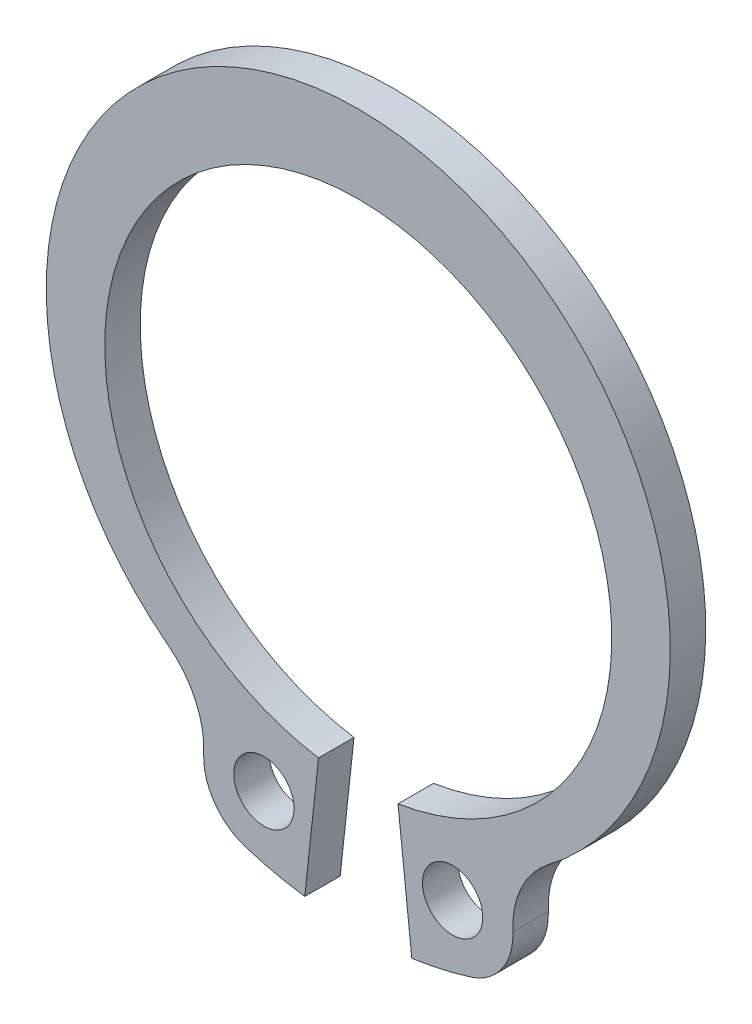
from build123d import *

# Parameters (mm, degrees)
ESQUISSE1_R          = 0.85
BASE_EXTRUSION_DEPTH = 1


with BuildPart() as part:
    # Esquisse1 → Base-Extrusion (new body)
    with BuildSketch(Plane.XY):
        with BuildLine():
            Line((1.12089314, -7.061593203), (1.509375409, -10.640570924))
            ThreePointArc((1.509375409, -10.640570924), (2.342444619, -10.488704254), (3.16097104, -10.27171971))
            ThreePointArc((3.16097104, -10.27171971), (4.050711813, -9.62599285), (4.35925706, -8.570814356))
            ThreePointArc((4.35925706, -8.570814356), (4.595162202, -7.379960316), (5.354975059, -6.433139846))
            ThreePointArc((5.354975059, -6.433139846), (0, 9.35), (-5.354975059, -6.433139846))
            ThreePointArc((-5.354975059, -6.433139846), (-4.595162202, -7.379960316), (-4.35925706, -8.570814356))
            ThreePointArc((-4.35925706, -8.570814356), (-4.050711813, -9.62599285), (-3.16097104, -10.27171971))
            ThreePointArc((-3.16097104, -10.27171971), (-2.342444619, -10.488704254), (-1.509375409, -10.640570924))
            Line((-1.509375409, -10.640570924), (-1.12089314, -7.061593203))
            ThreePointArc((-1.12089314, -7.061593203), (0, 7.15), (1.12089314, -7.061593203))
        make_face()
        with Locations((2.660961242, -8.646915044)):
            Circle(ESQUISSE1_R, mode=Mode.SUBTRACT)
        with Locations(Location((-2.660961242, -8.646915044, 0), (0, 0, 180))):
            Circle(ESQUISSE1_R, mode=Mode.SUBTRACT)
    extrude(amount=BASE_EXTRUSION_DEPTH)


solid = part.part
